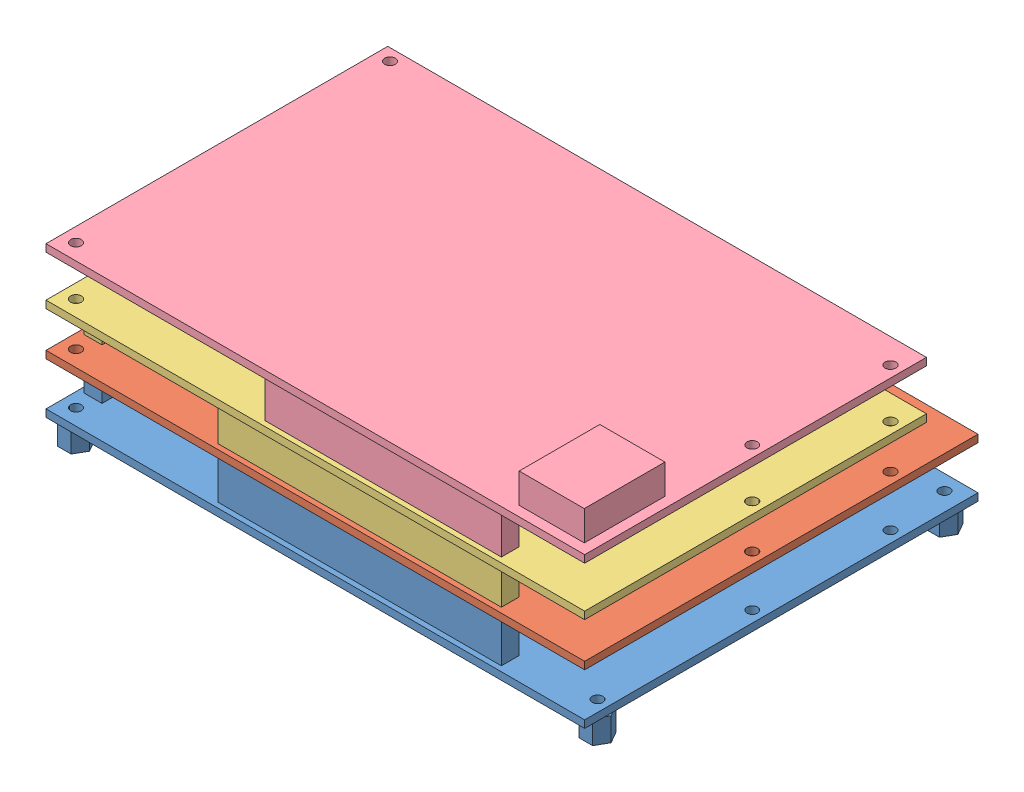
SolidWorks assembly BoardAssembly.SLDASM, configuration Default (file format 12000). Lengths in mm.
Overall size (146.54 55.17 106.57).
4 component instances, 4 part files, 9 mates.
Components (placement in the parent):
- powerboard-1: powerboard.SLDPRT [Default] at (3.8224 2.5781 -3.7685) size (146.54 20.09 106.57)
- ledboard-1: ledboard.SLDPRT [Default] at (3.8224 16.3195 -3.7685) size (145.94 2.01 106.57)
- fluidicsboard-1: fluidicsboard.SLDPRT [Default] at (3.8224 28.0924 -3.7685) size (145.94 11.77 92.6)
- daughterboard-1: daughterboard.SLDPRT [Default] at (3.8224 41.3385 -3.7685) size (145.94 21.3 92.6)
Mates (geometry in assembly coordinates):
- Coincident3: coincident anti-aligned: plane of powerboard-1 through (49.0344 16.3195 -10.0042) normal (0 1 0); plane of ledboard-1 through (3.8224 16.3195 -110.3342) normal (0 -1 0)
- Concentric1: concentric aligned: circle of powerboard-1; circle of ledboard-1
- Concentric2: concentric aligned: circle of powerboard-1; circle of ledboard-1
- Coincident6: coincident anti-aligned: plane of ledboard-1 through (3.8224 18.3261 -110.3342) normal (0 1 0); plane of fluidicsboard-1 through (49.0344 18.3261 -10.0042) normal (0 -1 0)
- Concentric3: concentric aligned: circle of ledboard-1; circle of fluidicsboard-1
- Concentric4: concentric aligned: circle of ledboard-1; circle of fluidicsboard-1
- Coincident9: coincident anti-aligned: plane of fluidicsboard-1 through (3.8224 30.099 -96.3642) normal (0 1 0); plane of daughterboard-1 through (61.709 30.099 -10.0042) normal (0 -1 0)
- Concentric5: concentric aligned: circle of fluidicsboard-1; circle of daughterboard-1
- Concentric6: concentric aligned: circle of fluidicsboard-1; circle of daughterboard-1
